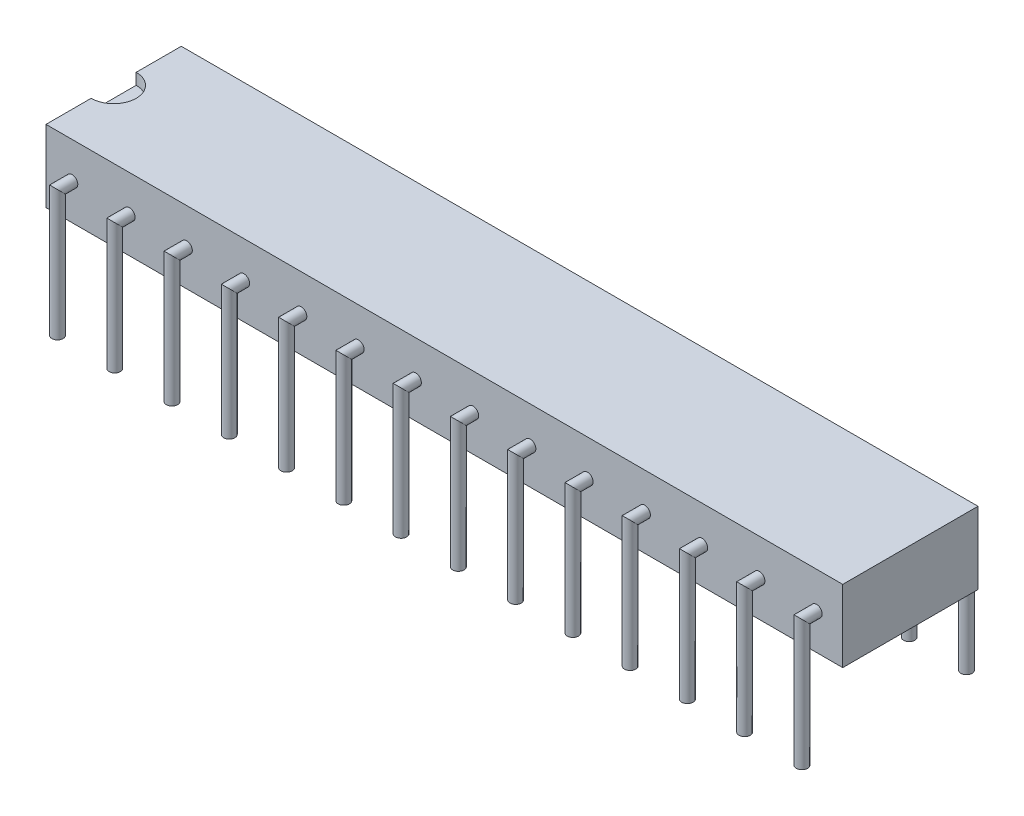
from build123d import *

# Parameters (mm, degrees)
ESQUISSE1_W                           = 6
ESQUISSE1_H                           = 3.2
EXTRUSION1_DEPTH                      = 35.34
ENL_V_MAT_EXTRU_1_DEPTH               = 0.5
ESQUISSE3_R                           = 0.25
R_P_TITION_LIN_AIRE1_COUNT            = 14
R_P_TITION_LIN_AIRE1_PITCH            = 2.54
R_P_TITION_LIN_AIRE1_COPY_1_SKETCH_R  = 0.25
R_P_TITION_LIN_AIRE1_COPY_2_SKETCH_R  = 0.25
R_P_TITION_LIN_AIRE1_COPY_3_SKETCH_R  = 0.25
R_P_TITION_LIN_AIRE1_COPY_4_SKETCH_R  = 0.25
R_P_TITION_LIN_AIRE1_COPY_5_SKETCH_R  = 0.25
R_P_TITION_LIN_AIRE1_COPY_6_SKETCH_R  = 0.25
R_P_TITION_LIN_AIRE1_COPY_7_SKETCH_R  = 0.25
R_P_TITION_LIN_AIRE1_COPY_8_SKETCH_R  = 0.25
R_P_TITION_LIN_AIRE1_COPY_9_SKETCH_R  = 0.25
R_P_TITION_LIN_AIRE1_COPY_10_SKETCH_R = 0.25
R_P_TITION_LIN_AIRE1_COPY_11_SKETCH_R = 0.25
R_P_TITION_LIN_AIRE1_COPY_12_SKETCH_R = 0.25
R_P_TITION_LIN_AIRE1_COPY_13_SKETCH_R = 0.25


with BuildPart() as part:
    # Esquisse1 → Extrusion1 (new body)
    with BuildSketch(Plane(origin=(0, 0, 0), x_dir=(0, 0, -1), z_dir=(1, 0, 0))):
        with Locations((0, 1.6)):
            Rectangle(ESQUISSE1_W, ESQUISSE1_H)
    extrude(amount=EXTRUSION1_DEPTH)

    # Esquisse2 → Enl_v. mat.-Extru.1 (cut)
    with BuildSketch(Plane(origin=(0, 3.2, 0), x_dir=(-1, 0, 0), z_dir=(0, 1, 0))):
        with BuildLine():
            Line((0, -1), (0, 1))
            ThreePointArc((0, 1), (-1, 0), (0, -1))
        make_face()
    extrude(amount=-ENL_V_MAT_EXTRU_1_DEPTH, mode=Mode.SUBTRACT)

    # Balayage1: sweep along a path in Esquisse5
    with BuildLine(Plane(origin=(1.16, 0, 0), x_dir=(0, 0, -1), z_dir=(1, 0, 0))) as balayage1_path:
        Line((-3, 1.6), (-3.65, 1.6))
        Line((-3.65, 1.6), (-3.65, -4))
    # Esquisse3 → Balayage1 (sweep)
    with BuildSketch(Plane.XY.offset(3)):
        with Locations((1.16, 1.6)):
            Circle(ESQUISSE3_R)
    balayage1 = sweep(path=balayage1_path.line, transition=Transition.RIGHT)

    # Sym_trie1: Balayage1 across plane
    add(balayage1.mirror(Plane.XY))

    # R_p_tition lin_aire1: Balayage1 ×14
    with Locations(*[(i * R_P_TITION_LIN_AIRE1_PITCH, 0, 0) for i in range(1, R_P_TITION_LIN_AIRE1_COUNT)]):
        add(balayage1)

    # R_p_tition lin_aire1 copy 1: sweep along a path in R_p_tition lin_aire1 copy 1 path
    with BuildLine(Plane(origin=(3.7, 0, 0), x_dir=(0, 0, 1), z_dir=(1, 0, 0))) as r_p_tition_lin_aire1_copy_1_path:
        Line((-3, -1.6), (-3.65, -1.6))
        Line((-3.65, -1.6), (-3.65, 4))
    # R_p_tition lin_aire1 copy 1 sketch → R_p_tition lin_aire1 copy 1 (sweep)
    with BuildSketch(Plane(origin=(2.54, 0, -3), x_dir=(1, 0, 0), z_dir=(0, 0, -1))):
        with Locations((1.16, -1.6)):
            Circle(R_P_TITION_LIN_AIRE1_COPY_1_SKETCH_R)
    sweep(path=r_p_tition_lin_aire1_copy_1_path.line, transition=Transition.RIGHT)

    # R_p_tition lin_aire1 copy 2: sweep along a path in R_p_tition lin_aire1 copy 2 path
    with BuildLine(Plane(origin=(6.24, 0, 0), x_dir=(0, 0, 1), z_dir=(1, 0, 0))) as r_p_tition_lin_aire1_copy_2_path:
        Line((-3, -1.6), (-3.65, -1.6))
        Line((-3.65, -1.6), (-3.65, 4))
    # R_p_tition lin_aire1 copy 2 sketch → R_p_tition lin_aire1 copy 2 (sweep)
    with BuildSketch(Plane(origin=(5.08, 0, -3), x_dir=(1, 0, 0), z_dir=(0, 0, -1))):
        with Locations((1.16, -1.6)):
            Circle(R_P_TITION_LIN_AIRE1_COPY_2_SKETCH_R)
    sweep(path=r_p_tition_lin_aire1_copy_2_path.line, transition=Transition.RIGHT)

    # R_p_tition lin_aire1 copy 3: sweep along a path in R_p_tition lin_aire1 copy 3 path
    with BuildLine(Plane(origin=(8.78, 0, 0), x_dir=(0, 0, 1), z_dir=(1, 0, 0))) as r_p_tition_lin_aire1_copy_3_path:
        Line((-3, -1.6), (-3.65, -1.6))
        Line((-3.65, -1.6), (-3.65, 4))
    # R_p_tition lin_aire1 copy 3 sketch → R_p_tition lin_aire1 copy 3 (sweep)
    with BuildSketch(Plane(origin=(7.62, 0, -3), x_dir=(1, 0, 0), z_dir=(0, 0, -1))):
        with Locations((1.16, -1.6)):
            Circle(R_P_TITION_LIN_AIRE1_COPY_3_SKETCH_R)
    sweep(path=r_p_tition_lin_aire1_copy_3_path.line, transition=Transition.RIGHT)

    # R_p_tition lin_aire1 copy 4: sweep along a path in R_p_tition lin_aire1 copy 4 path
    with BuildLine(Plane(origin=(11.32, 0, 0), x_dir=(0, 0, 1), z_dir=(1, 0, 0))) as r_p_tition_lin_aire1_copy_4_path:
        Line((-3, -1.6), (-3.65, -1.6))
        Line((-3.65, -1.6), (-3.65, 4))
    # R_p_tition lin_aire1 copy 4 sketch → R_p_tition lin_aire1 copy 4 (sweep)
    with BuildSketch(Plane(origin=(10.16, 0, -3), x_dir=(1, 0, 0), z_dir=(0, 0, -1))):
        with Locations((1.16, -1.6)):
            Circle(R_P_TITION_LIN_AIRE1_COPY_4_SKETCH_R)
    sweep(path=r_p_tition_lin_aire1_copy_4_path.line, transition=Transition.RIGHT)

    # R_p_tition lin_aire1 copy 5: sweep along a path in R_p_tition lin_aire1 copy 5 path
    with BuildLine(Plane(origin=(13.86, 0, 0), x_dir=(0, 0, 1), z_dir=(1, 0, 0))) as r_p_tition_lin_aire1_copy_5_path:
        Line((-3, -1.6), (-3.65, -1.6))
        Line((-3.65, -1.6), (-3.65, 4))
    # R_p_tition lin_aire1 copy 5 sketch → R_p_tition lin_aire1 copy 5 (sweep)
    with BuildSketch(Plane(origin=(12.7, 0, -3), x_dir=(1, 0, 0), z_dir=(0, 0, -1))):
        with Locations((1.16, -1.6)):
            Circle(R_P_TITION_LIN_AIRE1_COPY_5_SKETCH_R)
    sweep(path=r_p_tition_lin_aire1_copy_5_path.line, transition=Transition.RIGHT)

    # R_p_tition lin_aire1 copy 6: sweep along a path in R_p_tition lin_aire1 copy 6 path
    with BuildLine(Plane(origin=(16.4, 0, 0), x_dir=(0, 0, 1), z_dir=(1, 0, 0))) as r_p_tition_lin_aire1_copy_6_path:
        Line((-3, -1.6), (-3.65, -1.6))
        Line((-3.65, -1.6), (-3.65, 4))
    # R_p_tition lin_aire1 copy 6 sketch → R_p_tition lin_aire1 copy 6 (sweep)
    with BuildSketch(Plane(origin=(15.24, 0, -3), x_dir=(1, 0, 0), z_dir=(0, 0, -1))):
        with Locations((1.16, -1.6)):
            Circle(R_P_TITION_LIN_AIRE1_COPY_6_SKETCH_R)
    sweep(path=r_p_tition_lin_aire1_copy_6_path.line, transition=Transition.RIGHT)

    # R_p_tition lin_aire1 copy 7: sweep along a path in R_p_tition lin_aire1 copy 7 path
    with BuildLine(Plane(origin=(18.94, 0, 0), x_dir=(0, 0, 1), z_dir=(1, 0, 0))) as r_p_tition_lin_aire1_copy_7_path:
        Line((-3, -1.6), (-3.65, -1.6))
        Line((-3.65, -1.6), (-3.65, 4))
    # R_p_tition lin_aire1 copy 7 sketch → R_p_tition lin_aire1 copy 7 (sweep)
    with BuildSketch(Plane(origin=(17.78, 0, -3), x_dir=(1, 0, 0), z_dir=(0, 0, -1))):
        with Locations((1.16, -1.6)):
            Circle(R_P_TITION_LIN_AIRE1_COPY_7_SKETCH_R)
    sweep(path=r_p_tition_lin_aire1_copy_7_path.line, transition=Transition.RIGHT)

    # R_p_tition lin_aire1 copy 8: sweep along a path in R_p_tition lin_aire1 copy 8 path
    with BuildLine(Plane(origin=(21.48, 0, 0), x_dir=(0, 0, 1), z_dir=(1, 0, 0))) as r_p_tition_lin_aire1_copy_8_path:
        Line((-3, -1.6), (-3.65, -1.6))
        Line((-3.65, -1.6), (-3.65, 4))
    # R_p_tition lin_aire1 copy 8 sketch → R_p_tition lin_aire1 copy 8 (sweep)
    with BuildSketch(Plane(origin=(20.32, 0, -3), x_dir=(1, 0, 0), z_dir=(0, 0, -1))):
        with Locations((1.16, -1.6)):
            Circle(R_P_TITION_LIN_AIRE1_COPY_8_SKETCH_R)
    sweep(path=r_p_tition_lin_aire1_copy_8_path.line, transition=Transition.RIGHT)

    # R_p_tition lin_aire1 copy 9: sweep along a path in R_p_tition lin_aire1 copy 9 path
    with BuildLine(Plane(origin=(24.02, 0, 0), x_dir=(0, 0, 1), z_dir=(1, 0, 0))) as r_p_tition_lin_aire1_copy_9_path:
        Line((-3, -1.6), (-3.65, -1.6))
        Line((-3.65, -1.6), (-3.65, 4))
    # R_p_tition lin_aire1 copy 9 sketch → R_p_tition lin_aire1 copy 9 (sweep)
    with BuildSketch(Plane(origin=(22.86, 0, -3), x_dir=(1, 0, 0), z_dir=(0, 0, -1))):
        with Locations((1.16, -1.6)):
            Circle(R_P_TITION_LIN_AIRE1_COPY_9_SKETCH_R)
    sweep(path=r_p_tition_lin_aire1_copy_9_path.line, transition=Transition.RIGHT)

    # R_p_tition lin_aire1 copy 10: sweep along a path in R_p_tition lin_aire1 copy 10 path
    with BuildLine(Plane(origin=(26.56, 0, 0), x_dir=(0, 0, 1), z_dir=(1, 0, 0))) as r_p_tition_lin_aire1_copy_10_path:
        Line((-3, -1.6), (-3.65, -1.6))
        Line((-3.65, -1.6), (-3.65, 4))
    # R_p_tition lin_aire1 copy 10 sketch → R_p_tition lin_aire1 copy 10 (sweep)
    with BuildSketch(Plane(origin=(25.4, 0, -3), x_dir=(1, 0, 0), z_dir=(0, 0, -1))):
        with Locations((1.16, -1.6)):
            Circle(R_P_TITION_LIN_AIRE1_COPY_10_SKETCH_R)
    sweep(path=r_p_tition_lin_aire1_copy_10_path.line, transition=Transition.RIGHT)

    # R_p_tition lin_aire1 copy 11: sweep along a path in R_p_tition lin_aire1 copy 11 path
    with BuildLine(Plane(origin=(29.1, 0, 0), x_dir=(0, 0, 1), z_dir=(1, 0, 0))) as r_p_tition_lin_aire1_copy_11_path:
        Line((-3, -1.6), (-3.65, -1.6))
        Line((-3.65, -1.6), (-3.65, 4))
    # R_p_tition lin_aire1 copy 11 sketch → R_p_tition lin_aire1 copy 11 (sweep)
    with BuildSketch(Plane(origin=(27.94, 0, -3), x_dir=(1, 0, 0), z_dir=(0, 0, -1))):
        with Locations((1.16, -1.6)):
            Circle(R_P_TITION_LIN_AIRE1_COPY_11_SKETCH_R)
    sweep(path=r_p_tition_lin_aire1_copy_11_path.line, transition=Transition.RIGHT)

    # R_p_tition lin_aire1 copy 12: sweep along a path in R_p_tition lin_aire1 copy 12 path
    with BuildLine(Plane(origin=(31.64, 0, 0), x_dir=(0, 0, 1), z_dir=(1, 0, 0))) as r_p_tition_lin_aire1_copy_12_path:
        Line((-3, -1.6), (-3.65, -1.6))
        Line((-3.65, -1.6), (-3.65, 4))
    # R_p_tition lin_aire1 copy 12 sketch → R_p_tition lin_aire1 copy 12 (sweep)
    with BuildSketch(Plane(origin=(30.48, 0, -3), x_dir=(1, 0, 0), z_dir=(0, 0, -1))):
        with Locations((1.16, -1.6)):
            Circle(R_P_TITION_LIN_AIRE1_COPY_12_SKETCH_R)
    sweep(path=r_p_tition_lin_aire1_copy_12_path.line, transition=Transition.RIGHT)

    # R_p_tition lin_aire1 copy 13: sweep along a path in R_p_tition lin_aire1 copy 13 path
    with BuildLine(Plane(origin=(34.18, 0, 0), x_dir=(0, 0, 1), z_dir=(1, 0, 0))) as r_p_tition_lin_aire1_copy_13_path:
        Line((-3, -1.6), (-3.65, -1.6))
        Line((-3.65, -1.6), (-3.65, 4))
    # R_p_tition lin_aire1 copy 13 sketch → R_p_tition lin_aire1 copy 13 (sweep)
    with BuildSketch(Plane(origin=(33.02, 0, -3), x_dir=(1, 0, 0), z_dir=(0, 0, -1))):
        with Locations((1.16, -1.6)):
            Circle(R_P_TITION_LIN_AIRE1_COPY_13_SKETCH_R)
    sweep(path=r_p_tition_lin_aire1_copy_13_path.line, transition=Transition.RIGHT)


solid = part.part
